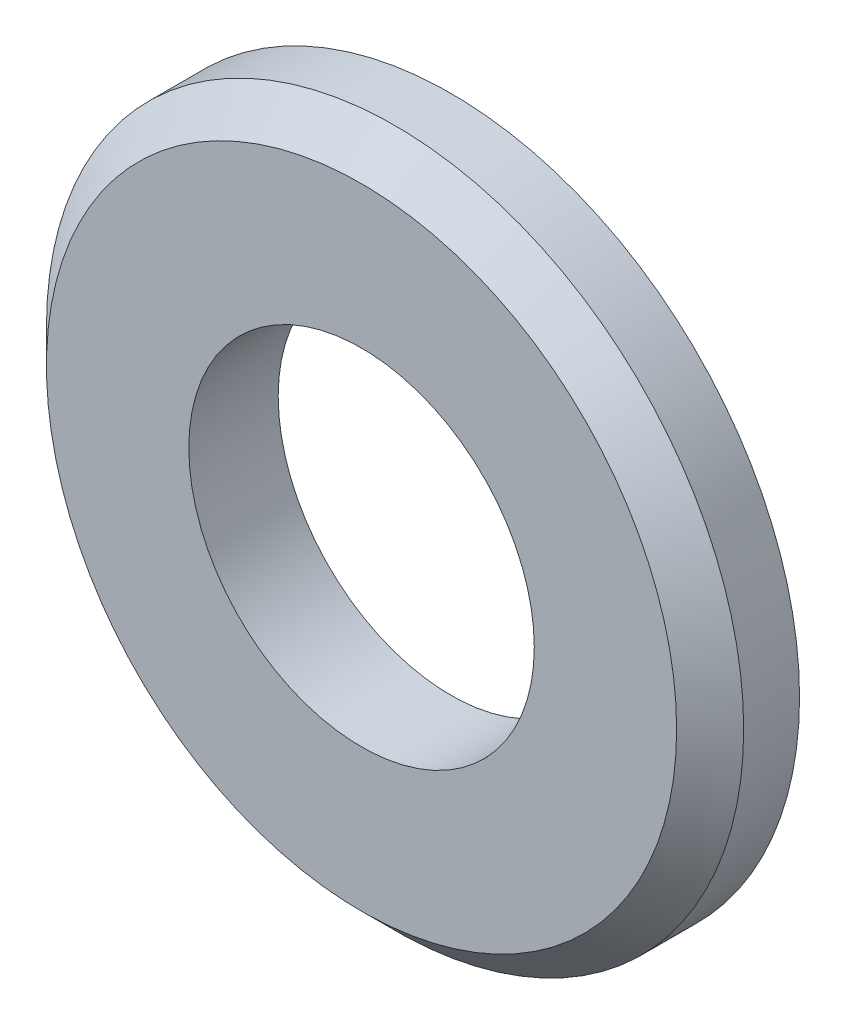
ISO-10303-21;
HEADER;
FILE_DESCRIPTION(('STEP AP214'),'2;1');
FILE_NAME('part.step','',(''),(''),'','','');
FILE_SCHEMA(('AUTOMOTIVE_DESIGN { 1 0 10303 214 1 1 1 1 }'));
ENDSEC;
DATA;
#1=APPLICATION_CONTEXT('core data for automotive mechanical design processes');
#2=APPLICATION_PROTOCOL_DEFINITION('international standard','automotive_design',2000,#1);
#3=PRODUCT_CONTEXT('',#1,'mechanical');
#4=PRODUCT('Part','Part','',(#3));
#5=PRODUCT_RELATED_PRODUCT_CATEGORY('part','',(#4));
#6=PRODUCT_DEFINITION_FORMATION('','',#4);
#7=PRODUCT_DEFINITION_CONTEXT('part definition',#1,'design');
#8=PRODUCT_DEFINITION('design','',#6,#7);
#9=PRODUCT_DEFINITION_SHAPE('','',#8);
#10=(LENGTH_UNIT() NAMED_UNIT(*) SI_UNIT(.MILLI.,.METRE.));
#11=(NAMED_UNIT(*) PLANE_ANGLE_UNIT() SI_UNIT($,.RADIAN.));
#12=(NAMED_UNIT(*) SI_UNIT($,.STERADIAN.) SOLID_ANGLE_UNIT());
#13=UNCERTAINTY_MEASURE_WITH_UNIT(LENGTH_MEASURE(1.E-05),#10,'distance_accuracy_value','');
#14=(GEOMETRIC_REPRESENTATION_CONTEXT(3) GLOBAL_UNCERTAINTY_ASSIGNED_CONTEXT((#13)) GLOBAL_UNIT_ASSIGNED_CONTEXT((#10,
#11,#12)) REPRESENTATION_CONTEXT('',''));
#15=CARTESIAN_POINT('',(0.,0.,0.));
#16=DIRECTION('',(0.,0.,1.));
#17=DIRECTION('',(1.,0.,0.));
#18=AXIS2_PLACEMENT_3D('',#15,#16,#17);
#19=CARTESIAN_POINT('',(0.,0.,1.016));
#20=DIRECTION('',(0.,0.,1.));
#21=DIRECTION('',(1.,0.,0.));
#22=AXIS2_PLACEMENT_3D('',#19,#20,#21);
#23=PLANE('',#22);
#24=CARTESIAN_POINT('',(0.,0.,1.016));
#25=DIRECTION('',(0.,0.,1.));
#26=DIRECTION('',(1.,0.,0.));
#27=AXIS2_PLACEMENT_3D('',#24,#25,#26);
#28=CIRCLE('',#27,3.5814);
#29=CARTESIAN_POINT('',(3.5814,0.,1.016));
#30=VERTEX_POINT('',#29);
#31=EDGE_CURVE('E40',#30,#30,#28,.T.);
#32=ORIENTED_EDGE('',*,*,#31,.T.);
#33=EDGE_LOOP('',(#32));
#34=FACE_BOUND('',#33,.T.);
#35=CARTESIAN_POINT('',(0.,0.,1.016));
#36=DIRECTION('',(0.,0.,1.));
#37=DIRECTION('',(1.,0.,0.));
#38=AXIS2_PLACEMENT_3D('',#35,#36,#37);
#39=CIRCLE('',#38,1.96342);
#40=CARTESIAN_POINT('',(1.96342,0.,1.016));
#41=VERTEX_POINT('',#40);
#42=EDGE_CURVE('E48',#41,#41,#39,.T.);
#43=ORIENTED_EDGE('',*,*,#42,.F.);
#44=EDGE_LOOP('',(#43));
#45=FACE_BOUND('',#44,.T.);
#46=ADVANCED_FACE('F33',(#34,#45),#23,.T.);
#47=CARTESIAN_POINT('',(0.,0.,0.));
#48=DIRECTION('',(0.,0.,1.));
#49=DIRECTION('',(1.,0.,0.));
#50=AXIS2_PLACEMENT_3D('',#47,#48,#49);
#51=PLANE('',#50);
#52=CARTESIAN_POINT('',(0.,0.,0.));
#53=DIRECTION('',(0.,0.,1.));
#54=DIRECTION('',(1.,0.,0.));
#55=AXIS2_PLACEMENT_3D('',#52,#53,#54);
#56=CIRCLE('',#55,3.9624);
#57=CARTESIAN_POINT('',(3.9624,0.,0.));
#58=VERTEX_POINT('',#57);
#59=EDGE_CURVE('E44',#58,#58,#56,.T.);
#60=ORIENTED_EDGE('',*,*,#59,.F.);
#61=EDGE_LOOP('',(#60));
#62=FACE_BOUND('',#61,.T.);
#63=CARTESIAN_POINT('',(0.,0.,0.));
#64=DIRECTION('',(0.,0.,1.));
#65=DIRECTION('',(1.,0.,0.));
#66=AXIS2_PLACEMENT_3D('',#63,#64,#65);
#67=CIRCLE('',#66,1.96342);
#68=CARTESIAN_POINT('',(1.96342,0.,0.));
#69=VERTEX_POINT('',#68);
#70=EDGE_CURVE('E51',#69,#69,#67,.T.);
#71=ORIENTED_EDGE('',*,*,#70,.T.);
#72=EDGE_LOOP('',(#71));
#73=FACE_BOUND('',#72,.T.);
#74=ADVANCED_FACE('F61',(#62,#73),#51,.F.);
#75=CARTESIAN_POINT('',(0.,0.,1.016));
#76=DIRECTION('',(0.,0.,-1.));
#77=DIRECTION('',(-1.,0.,0.));
#78=AXIS2_PLACEMENT_3D('',#75,#76,#77);
#79=CYLINDRICAL_SURFACE('',#78,3.9624);
#80=CARTESIAN_POINT('',(0.,0.,0.634999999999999));
#81=DIRECTION('',(0.,0.,1.));
#82=DIRECTION('',(1.,0.,0.));
#83=AXIS2_PLACEMENT_3D('',#80,#81,#82);
#84=CIRCLE('',#83,3.9624);
#85=CARTESIAN_POINT('',(3.9624,0.,0.634999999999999));
#86=VERTEX_POINT('',#85);
#87=EDGE_CURVE('E10',#86,#86,#84,.F.);
#88=ORIENTED_EDGE('',*,*,#87,.T.);
#89=EDGE_LOOP('',(#88));
#90=FACE_BOUND('',#89,.T.);
#91=ORIENTED_EDGE('',*,*,#59,.T.);
#92=EDGE_LOOP('',(#91));
#93=FACE_BOUND('',#92,.T.);
#94=ADVANCED_FACE('F66',(#90,#93),#79,.T.);
#95=CARTESIAN_POINT('',(0.,0.,1.016));
#96=DIRECTION('',(0.,0.,-1.));
#97=DIRECTION('',(-1.,0.,0.));
#98=AXIS2_PLACEMENT_3D('',#95,#96,#97);
#99=CYLINDRICAL_SURFACE('',#98,1.96342);
#100=ORIENTED_EDGE('',*,*,#42,.T.);
#101=EDGE_LOOP('',(#100));
#102=FACE_BOUND('',#101,.T.);
#103=ORIENTED_EDGE('',*,*,#70,.F.);
#104=EDGE_LOOP('',(#103));
#105=FACE_BOUND('',#104,.T.);
#106=ADVANCED_FACE('F57',(#102,#105),#99,.F.);
#107=CARTESIAN_POINT('',(0.,0.,1.016));
#108=DIRECTION('',(0.,0.,-1.));
#109=DIRECTION('',(-1.,0.,0.));
#110=AXIS2_PLACEMENT_3D('',#107,#108,#109);
#111=CONICAL_SURFACE('',#110,3.5814,0.785398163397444);
#112=ORIENTED_EDGE('',*,*,#87,.F.);
#113=EDGE_LOOP('',(#112));
#114=FACE_BOUND('',#113,.T.);
#115=ORIENTED_EDGE('',*,*,#31,.F.);
#116=EDGE_LOOP('',(#115));
#117=FACE_BOUND('',#116,.T.);
#118=ADVANCED_FACE('F35',(#114,#117),#111,.T.);
#119=CLOSED_SHELL('',(#46,#74,#94,#106,#118));
#120=MANIFOLD_SOLID_BREP('B2',#119);
#121=ADVANCED_BREP_SHAPE_REPRESENTATION('',(#18,#120),#14);
#122=SHAPE_DEFINITION_REPRESENTATION(#9,#121);
ENDSEC;
END-ISO-10303-21;
